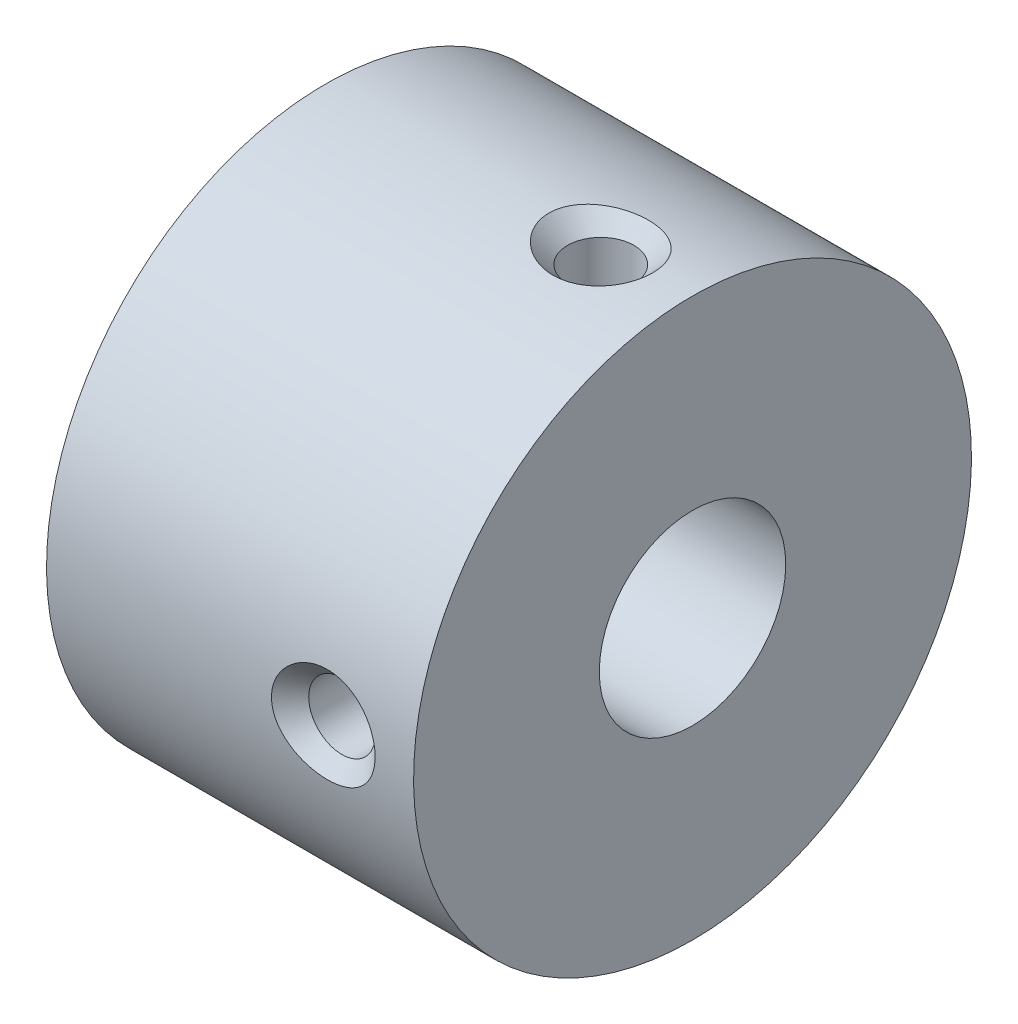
from build123d import *

# Parameters (mm, degrees)
SKETCH1_W                   = 12.5
SKETCH1_H                   = 9.5
F_1_4_0_25_DIAMETER_HOLE1_D = 6.35


with BuildPart() as part:
    # Sketch1 → Revolve1 (revolve)
    with BuildSketch(Plane.XY, mode=Mode.PRIVATE) as revolve1_sk:
        with Locations((0, 4.75)):
            Rectangle(SKETCH1_W, SKETCH1_H)
    revolve(revolve1_sk.sketch.rotate(Axis((-27.982188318, 0, 0), (1, 0, 0)), 180), axis=Axis((-27.982188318, 0, 0), (1, 0, 0)))

    # 1_4 _0.25_ Diameter Hole1 (through all)
    with Locations(Plane(origin=(6.25, 0, 0), x_dir=(0, 0, -1), z_dir=(1, 0, 0))):
        with Locations((0, 0)):
            Hole(F_1_4_0_25_DIAMETER_HOLE1_D / 2)

    # Sketch9 → 4-40 Tapped Hole3 (revolve, cut)
    with BuildSketch(Plane(origin=(3.125, 0, 0), x_dir=(0, 0, -1), z_dir=(1, 0, 0))):
        Polygon((0, 0), (0, 9.5), (1.7653, 9.5), (1.1303, 8.865), (1.1303, 0), align=None)
    revolve(axis=Axis((3.125, -6.35, 0), (0, 1, 0)), mode=Mode.SUBTRACT)

    # Sketch13 → 4-40 Tapped Hole4 (revolve, cut)
    with BuildSketch(Plane.YZ.offset(3.175)):
        Polygon((0, 0), (0, 9.5), (1.7653, 9.5), (1.1303, 8.865), (1.1303, 0), align=None)
    revolve(axis=Axis((3.175, 0, -6.35), (0, 0, 1)), mode=Mode.SUBTRACT)


solid = part.part
